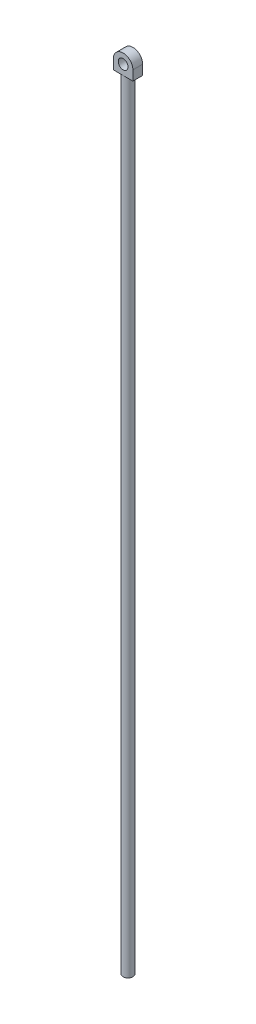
ISO-10303-21;
HEADER;
FILE_DESCRIPTION(('STEP AP214'),'2;1');
FILE_NAME('part.step','',(''),(''),'','','');
FILE_SCHEMA(('AUTOMOTIVE_DESIGN { 1 0 10303 214 1 1 1 1 }'));
ENDSEC;
DATA;
#1=APPLICATION_CONTEXT('core data for automotive mechanical design processes');
#2=APPLICATION_PROTOCOL_DEFINITION('international standard','automotive_design',2000,#1);
#3=PRODUCT_CONTEXT('',#1,'mechanical');
#4=PRODUCT('Part','Part','',(#3));
#5=PRODUCT_RELATED_PRODUCT_CATEGORY('part','',(#4));
#6=PRODUCT_DEFINITION_FORMATION('','',#4);
#7=PRODUCT_DEFINITION_CONTEXT('part definition',#1,'design');
#8=PRODUCT_DEFINITION('design','',#6,#7);
#9=PRODUCT_DEFINITION_SHAPE('','',#8);
#10=(LENGTH_UNIT() NAMED_UNIT(*) SI_UNIT(.MILLI.,.METRE.));
#11=(NAMED_UNIT(*) PLANE_ANGLE_UNIT() SI_UNIT($,.RADIAN.));
#12=(NAMED_UNIT(*) SI_UNIT($,.STERADIAN.) SOLID_ANGLE_UNIT());
#13=UNCERTAINTY_MEASURE_WITH_UNIT(LENGTH_MEASURE(1.E-05),#10,'distance_accuracy_value','');
#14=(GEOMETRIC_REPRESENTATION_CONTEXT(3) GLOBAL_UNCERTAINTY_ASSIGNED_CONTEXT((#13)) GLOBAL_UNIT_ASSIGNED_CONTEXT((#10,
#11,#12)) REPRESENTATION_CONTEXT('',''));
#15=CARTESIAN_POINT('',(0.,0.,0.));
#16=DIRECTION('',(0.,0.,1.));
#17=DIRECTION('',(1.,0.,0.));
#18=AXIS2_PLACEMENT_3D('',#15,#16,#17);
#19=CARTESIAN_POINT('',(-10.,-10.,5.));
#20=DIRECTION('',(0.,1.,0.));
#21=DIRECTION('',(0.,0.,1.));
#22=AXIS2_PLACEMENT_3D('',#19,#20,#21);
#23=PLANE('',#22);
#24=CARTESIAN_POINT('',(0.,-10.,0.));
#25=DIRECTION('',(0.,-1.,0.));
#26=DIRECTION('',(0.,0.,-1.));
#27=AXIS2_PLACEMENT_3D('',#24,#25,#26);
#28=CIRCLE('',#27,5.);
#29=CARTESIAN_POINT('',(0.,-10.,-5.));
#30=VERTEX_POINT('',#29);
#31=CARTESIAN_POINT('',(0.,-10.,5.));
#32=VERTEX_POINT('',#31);
#33=EDGE_CURVE('E49',#30,#32,#28,.T.);
#34=ORIENTED_EDGE('',*,*,#33,.F.);
#35=DIRECTION('',(1.,0.,0.));
#36=VECTOR('',#35,1.);
#37=CARTESIAN_POINT('',(-10.,-10.,-5.));
#38=LINE('',#37,#36);
#39=CARTESIAN_POINT('',(10.,-10.,-5.));
#40=VERTEX_POINT('',#39);
#41=EDGE_CURVE('E101',#30,#40,#38,.T.);
#42=ORIENTED_EDGE('',*,*,#41,.T.);
#43=DIRECTION('',(0.,0.,-1.));
#44=VECTOR('',#43,1.);
#45=CARTESIAN_POINT('',(10.,-10.,5.));
#46=LINE('',#45,#44);
#47=CARTESIAN_POINT('',(10.,-10.,5.));
#48=VERTEX_POINT('',#47);
#49=EDGE_CURVE('E161',#48,#40,#46,.T.);
#50=ORIENTED_EDGE('',*,*,#49,.F.);
#51=DIRECTION('',(1.,0.,0.));
#52=VECTOR('',#51,1.);
#53=CARTESIAN_POINT('',(-10.,-10.,5.));
#54=LINE('',#53,#52);
#55=EDGE_CURVE('E111',#32,#48,#54,.T.);
#56=ORIENTED_EDGE('',*,*,#55,.F.);
#57=EDGE_LOOP('',(#34,#42,#50,#56));
#58=FACE_BOUND('',#57,.T.);
#59=ADVANCED_FACE('F39',(#58),#23,.F.);
#60=CARTESIAN_POINT('',(0.,0.,5.));
#61=DIRECTION('',(0.,0.,1.));
#62=DIRECTION('',(1.,0.,0.));
#63=AXIS2_PLACEMENT_3D('',#60,#61,#62);
#64=PLANE('',#63);
#65=CARTESIAN_POINT('',(0.,0.,5.));
#66=DIRECTION('',(0.,0.,1.));
#67=DIRECTION('',(1.,0.,0.));
#68=AXIS2_PLACEMENT_3D('',#65,#66,#67);
#69=CIRCLE('',#68,10.);
#70=CARTESIAN_POINT('',(10.,0.,5.));
#71=VERTEX_POINT('',#70);
#72=CARTESIAN_POINT('',(-10.,0.,5.));
#73=VERTEX_POINT('',#72);
#74=EDGE_CURVE('E158',#71,#73,#69,.T.);
#75=ORIENTED_EDGE('',*,*,#74,.T.);
#76=DIRECTION('',(0.,-1.,0.));
#77=VECTOR('',#76,1.);
#78=CARTESIAN_POINT('',(-10.,0.,5.));
#79=LINE('',#78,#77);
#80=CARTESIAN_POINT('',(-10.,-10.,5.));
#81=VERTEX_POINT('',#80);
#82=EDGE_CURVE('E92',#73,#81,#79,.T.);
#83=ORIENTED_EDGE('',*,*,#82,.T.);
#84=EDGE_CURVE('E163',#81,#32,#54,.T.);
#85=ORIENTED_EDGE('',*,*,#84,.T.);
#86=ORIENTED_EDGE('',*,*,#55,.T.);
#87=DIRECTION('',(0.,1.,0.));
#88=VECTOR('',#87,1.);
#89=CARTESIAN_POINT('',(10.,-10.,5.));
#90=LINE('',#89,#88);
#91=EDGE_CURVE('E63',#48,#71,#90,.T.);
#92=ORIENTED_EDGE('',*,*,#91,.T.);
#93=EDGE_LOOP('',(#75,#83,#85,#86,#92));
#94=FACE_BOUND('',#93,.T.);
#95=CARTESIAN_POINT('',(0.,0.,5.));
#96=DIRECTION('',(0.,0.,1.));
#97=DIRECTION('',(1.,0.,0.));
#98=AXIS2_PLACEMENT_3D('',#95,#96,#97);
#99=CIRCLE('',#98,5.);
#100=CARTESIAN_POINT('',(5.,0.,5.));
#101=VERTEX_POINT('',#100);
#102=EDGE_CURVE('E153',#101,#101,#99,.T.);
#103=ORIENTED_EDGE('',*,*,#102,.F.);
#104=EDGE_LOOP('',(#103));
#105=FACE_BOUND('',#104,.T.);
#106=ADVANCED_FACE('F132',(#94,#105),#64,.T.);
#107=CARTESIAN_POINT('',(0.,0.,-5.));
#108=DIRECTION('',(0.,0.,1.));
#109=DIRECTION('',(1.,0.,0.));
#110=AXIS2_PLACEMENT_3D('',#107,#108,#109);
#111=PLANE('',#110);
#112=CARTESIAN_POINT('',(0.,0.,-5.));
#113=DIRECTION('',(0.,0.,1.));
#114=DIRECTION('',(1.,0.,0.));
#115=AXIS2_PLACEMENT_3D('',#112,#113,#114);
#116=CIRCLE('',#115,10.);
#117=CARTESIAN_POINT('',(10.,0.,-5.));
#118=VERTEX_POINT('',#117);
#119=CARTESIAN_POINT('',(-10.,0.,-5.));
#120=VERTEX_POINT('',#119);
#121=EDGE_CURVE('E151',#118,#120,#116,.T.);
#122=ORIENTED_EDGE('',*,*,#121,.F.);
#123=DIRECTION('',(0.,1.,0.));
#124=VECTOR('',#123,1.);
#125=CARTESIAN_POINT('',(10.,-10.,-5.));
#126=LINE('',#125,#124);
#127=EDGE_CURVE('E84',#40,#118,#126,.T.);
#128=ORIENTED_EDGE('',*,*,#127,.F.);
#129=ORIENTED_EDGE('',*,*,#41,.F.);
#130=CARTESIAN_POINT('',(-10.,-10.,-5.));
#131=VERTEX_POINT('',#130);
#132=EDGE_CURVE('E96',#131,#30,#38,.T.);
#133=ORIENTED_EDGE('',*,*,#132,.F.);
#134=DIRECTION('',(0.,-1.,0.));
#135=VECTOR('',#134,1.);
#136=CARTESIAN_POINT('',(-10.,0.,-5.));
#137=LINE('',#136,#135);
#138=EDGE_CURVE('E109',#120,#131,#137,.T.);
#139=ORIENTED_EDGE('',*,*,#138,.F.);
#140=EDGE_LOOP('',(#122,#128,#129,#133,#139));
#141=FACE_BOUND('',#140,.T.);
#142=CARTESIAN_POINT('',(0.,0.,-5.));
#143=DIRECTION('',(0.,0.,1.));
#144=DIRECTION('',(1.,0.,0.));
#145=AXIS2_PLACEMENT_3D('',#142,#143,#144);
#146=CIRCLE('',#145,5.);
#147=CARTESIAN_POINT('',(5.,0.,-5.));
#148=VERTEX_POINT('',#147);
#149=EDGE_CURVE('E168',#148,#148,#146,.T.);
#150=ORIENTED_EDGE('',*,*,#149,.T.);
#151=EDGE_LOOP('',(#150));
#152=FACE_BOUND('',#151,.T.);
#153=ADVANCED_FACE('F105',(#141,#152),#111,.F.);
#154=CARTESIAN_POINT('',(0.,0.,5.));
#155=DIRECTION('',(0.,0.,-1.));
#156=DIRECTION('',(-1.,0.,0.));
#157=AXIS2_PLACEMENT_3D('',#154,#155,#156);
#158=CYLINDRICAL_SURFACE('',#157,10.);
#159=ORIENTED_EDGE('',*,*,#121,.T.);
#160=DIRECTION('',(0.,0.,-1.));
#161=VECTOR('',#160,1.);
#162=CARTESIAN_POINT('',(-10.,0.,5.));
#163=LINE('',#162,#161);
#164=EDGE_CURVE('E43',#73,#120,#163,.T.);
#165=ORIENTED_EDGE('',*,*,#164,.F.);
#166=ORIENTED_EDGE('',*,*,#74,.F.);
#167=DIRECTION('',(0.,0.,-1.));
#168=VECTOR('',#167,1.);
#169=CARTESIAN_POINT('',(10.,0.,5.));
#170=LINE('',#169,#168);
#171=EDGE_CURVE('E159',#71,#118,#170,.T.);
#172=ORIENTED_EDGE('',*,*,#171,.T.);
#173=EDGE_LOOP('',(#159,#165,#166,#172));
#174=FACE_BOUND('',#173,.T.);
#175=ADVANCED_FACE('F41',(#174),#158,.T.);
#176=CARTESIAN_POINT('',(-10.,0.,5.));
#177=DIRECTION('',(1.,0.,0.));
#178=DIRECTION('',(0.,1.,0.));
#179=AXIS2_PLACEMENT_3D('',#176,#177,#178);
#180=PLANE('',#179);
#181=ORIENTED_EDGE('',*,*,#138,.T.);
#182=DIRECTION('',(0.,0.,-1.));
#183=VECTOR('',#182,1.);
#184=CARTESIAN_POINT('',(-10.,-10.,5.));
#185=LINE('',#184,#183);
#186=EDGE_CURVE('E99',#81,#131,#185,.T.);
#187=ORIENTED_EDGE('',*,*,#186,.F.);
#188=ORIENTED_EDGE('',*,*,#82,.F.);
#189=ORIENTED_EDGE('',*,*,#164,.T.);
#190=EDGE_LOOP('',(#181,#187,#188,#189));
#191=FACE_BOUND('',#190,.T.);
#192=ADVANCED_FACE('F140',(#191),#180,.F.);
#193=EDGE_CURVE('E11',#32,#30,#28,.T.);
#194=ORIENTED_EDGE('',*,*,#193,.F.);
#195=ORIENTED_EDGE('',*,*,#84,.F.);
#196=ORIENTED_EDGE('',*,*,#186,.T.);
#197=ORIENTED_EDGE('',*,*,#132,.T.);
#198=EDGE_LOOP('',(#194,#195,#196,#197));
#199=FACE_BOUND('',#198,.T.);
#200=ADVANCED_FACE('F98',(#199),#23,.F.);
#201=CARTESIAN_POINT('',(10.,-10.,5.));
#202=DIRECTION('',(-1.,0.,0.));
#203=DIRECTION('',(0.,-1.,0.));
#204=AXIS2_PLACEMENT_3D('',#201,#202,#203);
#205=PLANE('',#204);
#206=ORIENTED_EDGE('',*,*,#127,.T.);
#207=ORIENTED_EDGE('',*,*,#171,.F.);
#208=ORIENTED_EDGE('',*,*,#91,.F.);
#209=ORIENTED_EDGE('',*,*,#49,.T.);
#210=EDGE_LOOP('',(#206,#207,#208,#209));
#211=FACE_BOUND('',#210,.T.);
#212=ADVANCED_FACE('F127',(#211),#205,.F.);
#213=CARTESIAN_POINT('',(0.,0.,5.));
#214=DIRECTION('',(0.,0.,-1.));
#215=DIRECTION('',(-1.,0.,0.));
#216=AXIS2_PLACEMENT_3D('',#213,#214,#215);
#217=CYLINDRICAL_SURFACE('',#216,5.);
#218=ORIENTED_EDGE('',*,*,#102,.T.);
#219=EDGE_LOOP('',(#218));
#220=FACE_BOUND('',#219,.T.);
#221=ORIENTED_EDGE('',*,*,#149,.F.);
#222=EDGE_LOOP('',(#221));
#223=FACE_BOUND('',#222,.T.);
#224=ADVANCED_FACE('F118',(#220,#223),#217,.F.);
#225=CARTESIAN_POINT('',(0.,-810.,0.));
#226=DIRECTION('',(0.,1.,0.));
#227=DIRECTION('',(0.,0.,1.));
#228=AXIS2_PLACEMENT_3D('',#225,#226,#227);
#229=CYLINDRICAL_SURFACE('',#228,5.);
#230=CARTESIAN_POINT('',(0.,-810.,0.));
#231=DIRECTION('',(0.,-1.,0.));
#232=DIRECTION('',(0.,0.,-1.));
#233=AXIS2_PLACEMENT_3D('',#230,#231,#232);
#234=CIRCLE('',#233,5.);
#235=CARTESIAN_POINT('',(0.,-810.,-5.));
#236=VERTEX_POINT('',#235);
#237=EDGE_CURVE('E114',#236,#236,#234,.T.);
#238=ORIENTED_EDGE('',*,*,#237,.F.);
#239=EDGE_LOOP('',(#238));
#240=FACE_BOUND('',#239,.T.);
#241=ORIENTED_EDGE('',*,*,#33,.T.);
#242=ORIENTED_EDGE('',*,*,#193,.T.);
#243=EDGE_LOOP('',(#241,#242));
#244=FACE_BOUND('',#243,.T.);
#245=ADVANCED_FACE('F115',(#240,#244),#229,.T.);
#246=CARTESIAN_POINT('',(0.,-810.,0.));
#247=DIRECTION('',(0.,-1.,0.));
#248=DIRECTION('',(0.,0.,-1.));
#249=AXIS2_PLACEMENT_3D('',#246,#247,#248);
#250=PLANE('',#249);
#251=ORIENTED_EDGE('',*,*,#237,.T.);
#252=EDGE_LOOP('',(#251));
#253=FACE_BOUND('',#252,.T.);
#254=ADVANCED_FACE('F117',(#253),#250,.T.);
#255=CLOSED_SHELL('',(#59,#106,#153,#175,#192,#200,#212,#224,#245,#254));
#256=MANIFOLD_SOLID_BREP('B2',#255);
#257=ADVANCED_BREP_SHAPE_REPRESENTATION('',(#18,#256),#14);
#258=SHAPE_DEFINITION_REPRESENTATION(#9,#257);
ENDSEC;
END-ISO-10303-21;
